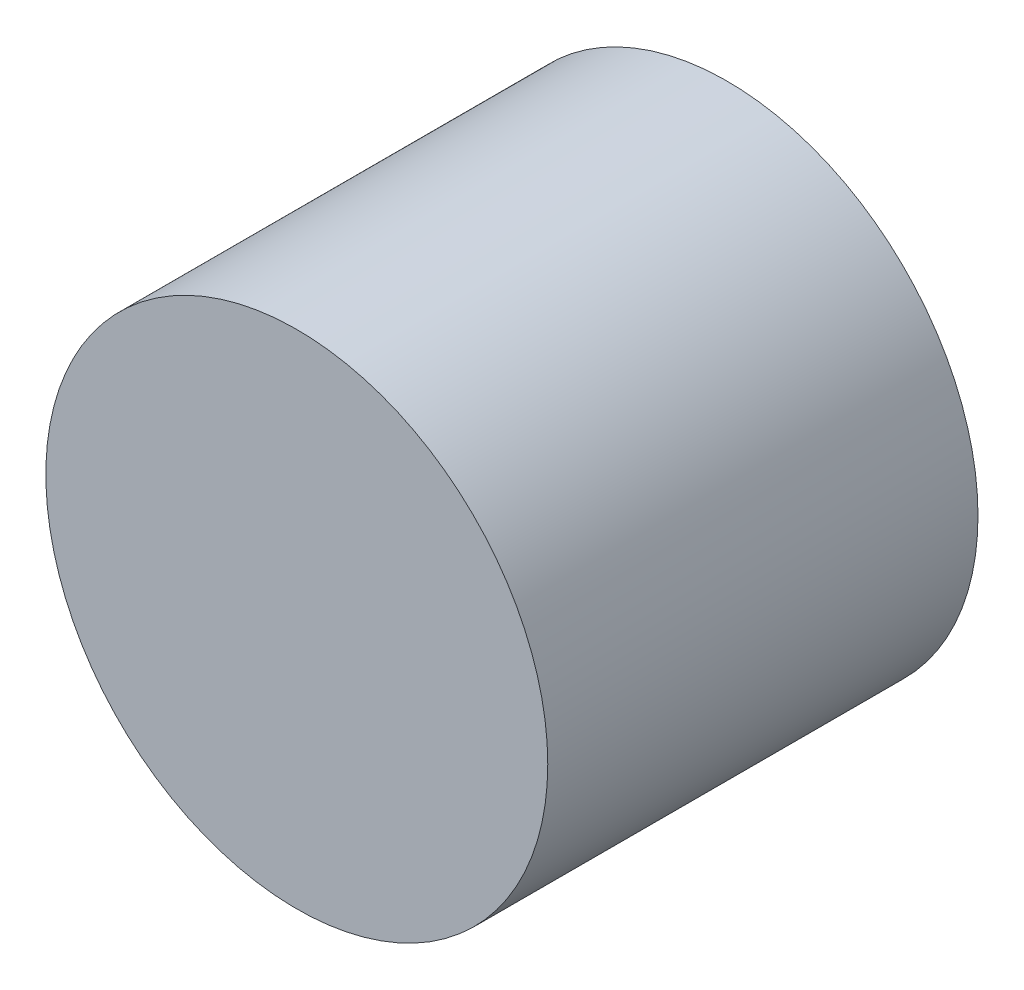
from build123d import *

# Parameters (mm, degrees)
SKETCH1_R           = 17.5
BOSS_EXTRUDE1_DEPTH = 30


with BuildPart() as part:
    # Sketch1 → Boss-Extrude1 (new body)
    with BuildSketch(Plane.XY):
        Circle(SKETCH1_R)
    extrude(amount=BOSS_EXTRUDE1_DEPTH)


solid = part.part
